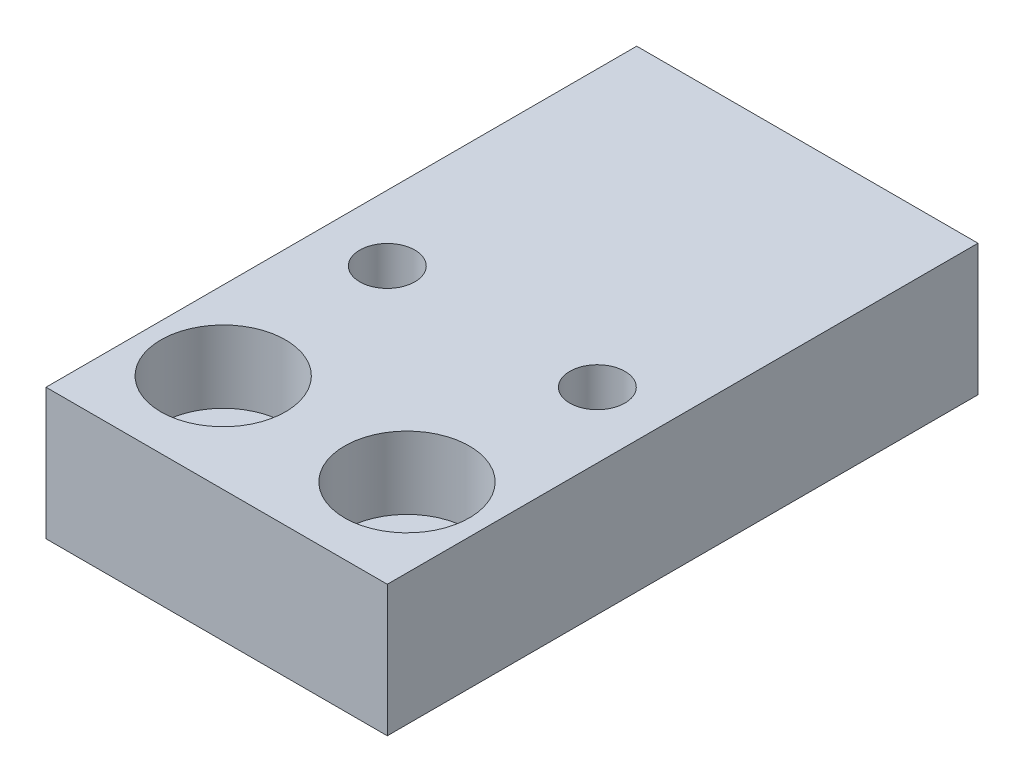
from build123d import *

# Parameters (mm, degrees)
SKETCH_1_W          = 26
SKETCH_1_H          = 45
SKETCH_1_R          = 2.75
SKETCH_1_R_2        = 2.1
EXTRUDE_1_DEPTH     = 10
SKETCH_2_R          = 4.75
CUT_EXTRUDE_1_DEPTH = 5.5


with BuildPart() as part:
    # Sketch 1 → Extrude 1 (new body)
    with BuildSketch(Plane(origin=(0, 0, 0), x_dir=(1, 0, 0), z_dir=(0, 1, 0))):
        with Locations((13, -22.5)):
            Rectangle(SKETCH_1_W, SKETCH_1_H)
        with Locations(Location((6, -37.5, 0), (0, 0, 270))):
            Circle(SKETCH_1_R, mode=Mode.SUBTRACT)
        with Locations(Location((20, -37.5, 0), (0, 0, 270))):
            Circle(SKETCH_1_R, mode=Mode.SUBTRACT)
        with Locations(Location((21, -24, 0), (0, 0, 270))):
            Circle(SKETCH_1_R_2, mode=Mode.SUBTRACT)
        with Locations(Location((5, -24, 0), (0, 0, 270))):
            Circle(SKETCH_1_R_2, mode=Mode.SUBTRACT)
    extrude(amount=EXTRUDE_1_DEPTH)

    # Sketch 2 → Cut-Extrude 1 (cut)
    with BuildSketch(Plane(origin=(0, 10, 0), x_dir=(1, 0, 0), z_dir=(0, 1, 0))):
        with Locations(Location((6, -37.5, 0), (0, 0, 270))):
            Circle(SKETCH_2_R)
        with Locations(Location((20, -37.5, 0), (0, 0, 270))):
            Circle(SKETCH_2_R)
    extrude(amount=-CUT_EXTRUDE_1_DEPTH, mode=Mode.SUBTRACT)


solid = part.part
